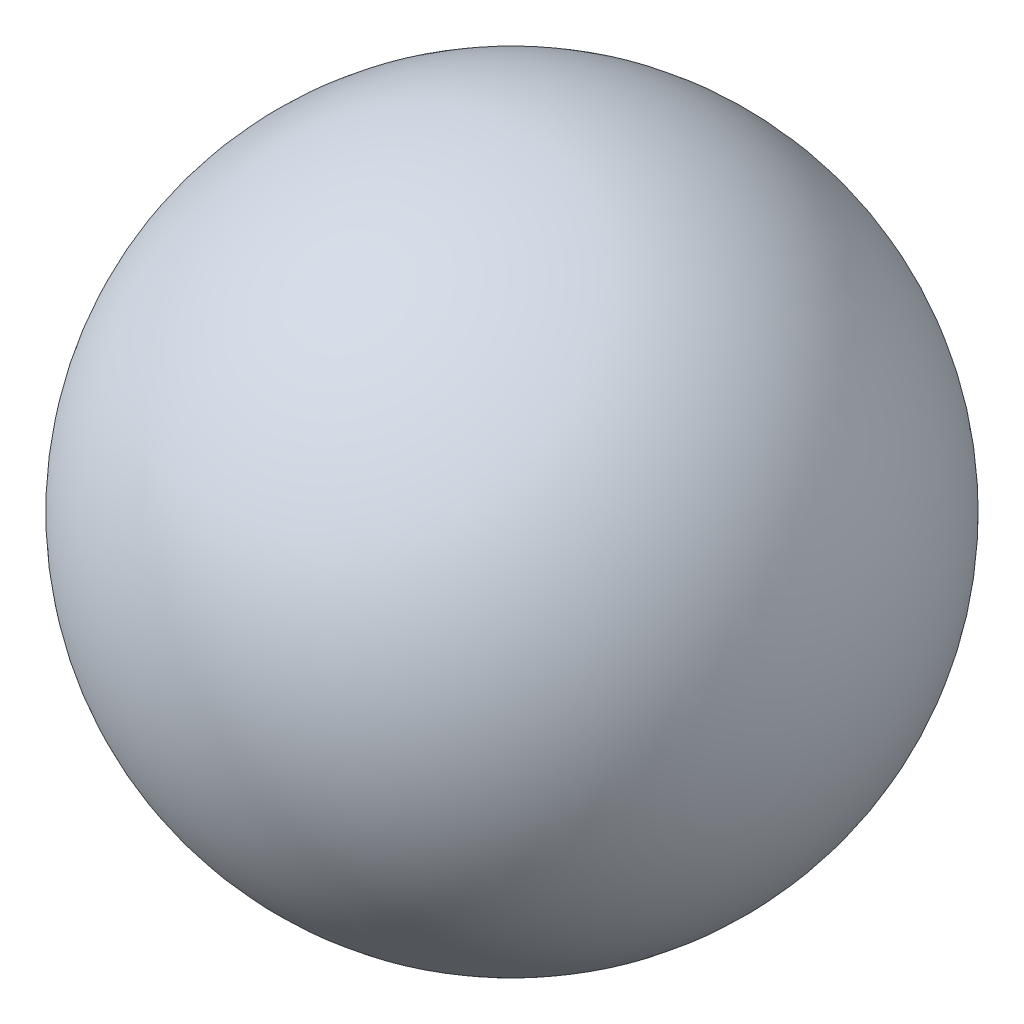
ISO-10303-21;
HEADER;
FILE_DESCRIPTION(('STEP AP214'),'2;1');
FILE_NAME('part.step','',(''),(''),'','','');
FILE_SCHEMA(('AUTOMOTIVE_DESIGN { 1 0 10303 214 1 1 1 1 }'));
ENDSEC;
DATA;
#1=APPLICATION_CONTEXT('core data for automotive mechanical design processes');
#2=APPLICATION_PROTOCOL_DEFINITION('international standard','automotive_design',2000,#1);
#3=PRODUCT_CONTEXT('',#1,'mechanical');
#4=PRODUCT('Part','Part','',(#3));
#5=PRODUCT_RELATED_PRODUCT_CATEGORY('part','',(#4));
#6=PRODUCT_DEFINITION_FORMATION('','',#4);
#7=PRODUCT_DEFINITION_CONTEXT('part definition',#1,'design');
#8=PRODUCT_DEFINITION('design','',#6,#7);
#9=PRODUCT_DEFINITION_SHAPE('','',#8);
#10=(LENGTH_UNIT() NAMED_UNIT(*) SI_UNIT(.MILLI.,.METRE.));
#11=(NAMED_UNIT(*) PLANE_ANGLE_UNIT() SI_UNIT($,.RADIAN.));
#12=(NAMED_UNIT(*) SI_UNIT($,.STERADIAN.) SOLID_ANGLE_UNIT());
#13=UNCERTAINTY_MEASURE_WITH_UNIT(LENGTH_MEASURE(1.E-05),#10,'distance_accuracy_value','');
#14=(GEOMETRIC_REPRESENTATION_CONTEXT(3) GLOBAL_UNCERTAINTY_ASSIGNED_CONTEXT((#13)) GLOBAL_UNIT_ASSIGNED_CONTEXT((#10,
#11,#12)) REPRESENTATION_CONTEXT('',''));
#15=CARTESIAN_POINT('',(0.,0.,0.));
#16=DIRECTION('',(0.,0.,1.));
#17=DIRECTION('',(1.,0.,0.));
#18=AXIS2_PLACEMENT_3D('',#15,#16,#17);
#19=CARTESIAN_POINT('',(0.,3.9975,0.));
#20=DIRECTION('',(0.,1.,0.));
#21=DIRECTION('',(0.,0.,-1.));
#22=AXIS2_PLACEMENT_3D('',#19,#20,#21);
#23=SPHERICAL_SURFACE('',#22,0.5955);
#24=CARTESIAN_POINT('',(0.,4.593,0.));
#25=VERTEX_POINT('',#24);
#26=VERTEX_LOOP('',#25);
#27=FACE_BOUND('',#26,.T.);
#28=CARTESIAN_POINT('',(0.,3.402,0.));
#29=VERTEX_POINT('',#28);
#30=VERTEX_LOOP('',#29);
#31=FACE_BOUND('',#30,.T.);
#32=ADVANCED_FACE('F16',(#27,#31),#23,.T.);
#33=CLOSED_SHELL('',(#32));
#34=MANIFOLD_SOLID_BREP('B1',#33);
#35=ADVANCED_BREP_SHAPE_REPRESENTATION('',(#18,#34),#14);
#36=SHAPE_DEFINITION_REPRESENTATION(#9,#35);
ENDSEC;
END-ISO-10303-21;
